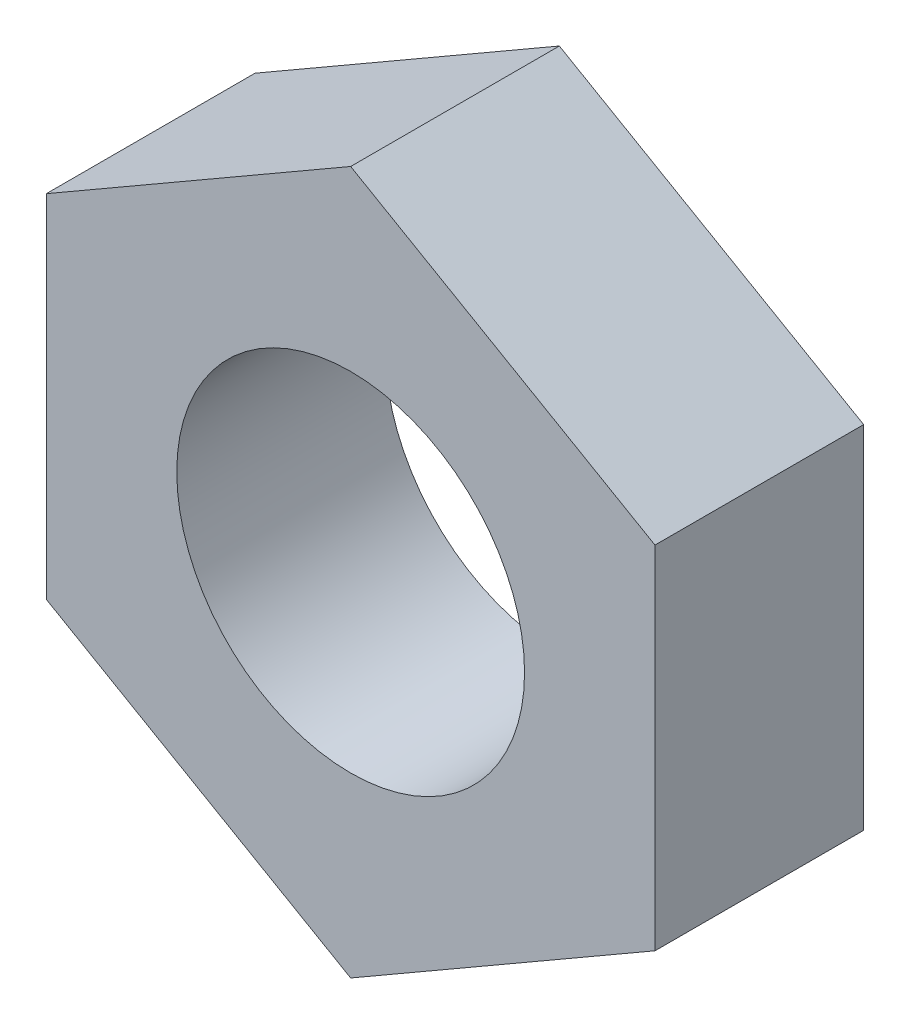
ISO-10303-21;
HEADER;
FILE_DESCRIPTION(('STEP AP214'),'2;1');
FILE_NAME('part.step','',(''),(''),'','','');
FILE_SCHEMA(('AUTOMOTIVE_DESIGN { 1 0 10303 214 1 1 1 1 }'));
ENDSEC;
DATA;
#1=APPLICATION_CONTEXT('core data for automotive mechanical design processes');
#2=APPLICATION_PROTOCOL_DEFINITION('international standard','automotive_design',2000,#1);
#3=PRODUCT_CONTEXT('',#1,'mechanical');
#4=PRODUCT('Part','Part','',(#3));
#5=PRODUCT_RELATED_PRODUCT_CATEGORY('part','',(#4));
#6=PRODUCT_DEFINITION_FORMATION('','',#4);
#7=PRODUCT_DEFINITION_CONTEXT('part definition',#1,'design');
#8=PRODUCT_DEFINITION('design','',#6,#7);
#9=PRODUCT_DEFINITION_SHAPE('','',#8);
#10=(LENGTH_UNIT() NAMED_UNIT(*) SI_UNIT(.MILLI.,.METRE.));
#11=(NAMED_UNIT(*) PLANE_ANGLE_UNIT() SI_UNIT($,.RADIAN.));
#12=(NAMED_UNIT(*) SI_UNIT($,.STERADIAN.) SOLID_ANGLE_UNIT());
#13=UNCERTAINTY_MEASURE_WITH_UNIT(LENGTH_MEASURE(1.E-05),#10,'distance_accuracy_value','');
#14=(GEOMETRIC_REPRESENTATION_CONTEXT(3) GLOBAL_UNCERTAINTY_ASSIGNED_CONTEXT((#13)) GLOBAL_UNIT_ASSIGNED_CONTEXT((#10,
#11,#12)) REPRESENTATION_CONTEXT('',''));
#15=CARTESIAN_POINT('',(0.,0.,0.));
#16=DIRECTION('',(0.,0.,1.));
#17=DIRECTION('',(1.,0.,0.));
#18=AXIS2_PLACEMENT_3D('',#15,#16,#17);
#19=CARTESIAN_POINT('',(3.5,2.02072594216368,2.4));
#20=DIRECTION('',(-0.5,-0.866025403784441,0.));
#21=DIRECTION('',(0.86602540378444,-0.5,0.));
#22=AXIS2_PLACEMENT_3D('',#19,#20,#21);
#23=PLANE('',#22);
#24=DIRECTION('',(-0.86602540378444,0.5,0.));
#25=VECTOR('',#24,1.);
#26=CARTESIAN_POINT('',(3.5,2.02072594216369,0.));
#27=LINE('',#26,#25);
#28=CARTESIAN_POINT('',(3.5,2.02072594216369,0.));
#29=VERTEX_POINT('',#28);
#30=CARTESIAN_POINT('',(0.,4.04145188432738,0.));
#31=VERTEX_POINT('',#30);
#32=EDGE_CURVE('E70',#29,#31,#27,.T.);
#33=ORIENTED_EDGE('',*,*,#32,.T.);
#34=DIRECTION('',(0.,0.,-1.));
#35=VECTOR('',#34,1.);
#36=CARTESIAN_POINT('',(0.,4.04145188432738,2.4));
#37=LINE('',#36,#35);
#38=CARTESIAN_POINT('',(0.,4.04145188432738,2.4));
#39=VERTEX_POINT('',#38);
#40=EDGE_CURVE('E9',#39,#31,#37,.T.);
#41=ORIENTED_EDGE('',*,*,#40,.F.);
#42=DIRECTION('',(-0.86602540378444,0.5,0.));
#43=VECTOR('',#42,1.);
#44=CARTESIAN_POINT('',(3.5,2.02072594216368,2.4));
#45=LINE('',#44,#43);
#46=CARTESIAN_POINT('',(3.5,2.02072594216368,2.4));
#47=VERTEX_POINT('',#46);
#48=EDGE_CURVE('E98',#47,#39,#45,.T.);
#49=ORIENTED_EDGE('',*,*,#48,.F.);
#50=DIRECTION('',(0.,0.,-1.));
#51=VECTOR('',#50,1.);
#52=CARTESIAN_POINT('',(3.5,2.02072594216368,2.4));
#53=LINE('',#52,#51);
#54=EDGE_CURVE('E83',#47,#29,#53,.T.);
#55=ORIENTED_EDGE('',*,*,#54,.T.);
#56=EDGE_LOOP('',(#33,#41,#49,#55));
#57=FACE_BOUND('',#56,.T.);
#58=ADVANCED_FACE('F14',(#57),#23,.F.);
#59=CARTESIAN_POINT('',(0.,4.04145188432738,2.4));
#60=DIRECTION('',(0.5,-0.866025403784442,0.));
#61=DIRECTION('',(0.866025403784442,0.5,0.));
#62=AXIS2_PLACEMENT_3D('',#59,#60,#61);
#63=PLANE('',#62);
#64=DIRECTION('',(-0.866025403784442,-0.5,0.));
#65=VECTOR('',#64,1.);
#66=CARTESIAN_POINT('',(0.,4.04145188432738,0.));
#67=LINE('',#66,#65);
#68=CARTESIAN_POINT('',(-3.5,2.0207259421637,0.));
#69=VERTEX_POINT('',#68);
#70=EDGE_CURVE('E66',#31,#69,#67,.T.);
#71=ORIENTED_EDGE('',*,*,#70,.T.);
#72=DIRECTION('',(0.,0.,-1.));
#73=VECTOR('',#72,1.);
#74=CARTESIAN_POINT('',(-3.5,2.02072594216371,2.39999999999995));
#75=LINE('',#74,#73);
#76=CARTESIAN_POINT('',(-3.5,2.02072594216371,2.39999999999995));
#77=VERTEX_POINT('',#76);
#78=EDGE_CURVE('E21',#77,#69,#75,.T.);
#79=ORIENTED_EDGE('',*,*,#78,.F.);
#80=DIRECTION('',(-0.866025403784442,-0.5,0.));
#81=VECTOR('',#80,1.);
#82=CARTESIAN_POINT('',(0.,4.04145188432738,2.4));
#83=LINE('',#82,#81);
#84=EDGE_CURVE('E79',#39,#77,#83,.T.);
#85=ORIENTED_EDGE('',*,*,#84,.F.);
#86=ORIENTED_EDGE('',*,*,#40,.T.);
#87=EDGE_LOOP('',(#71,#79,#85,#86));
#88=FACE_BOUND('',#87,.T.);
#89=ADVANCED_FACE('F78',(#88),#63,.F.);
#90=CARTESIAN_POINT('',(-3.5,2.02072594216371,2.39999999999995));
#91=DIRECTION('',(1.,0.,0.));
#92=DIRECTION('',(0.,1.,0.));
#93=AXIS2_PLACEMENT_3D('',#90,#91,#92);
#94=PLANE('',#93);
#95=DIRECTION('',(0.,-1.,0.));
#96=VECTOR('',#95,1.);
#97=CARTESIAN_POINT('',(-3.5,2.0207259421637,0.));
#98=LINE('',#97,#96);
#99=CARTESIAN_POINT('',(-3.5,-2.02072594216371,0.));
#100=VERTEX_POINT('',#99);
#101=EDGE_CURVE('E72',#69,#100,#98,.T.);
#102=ORIENTED_EDGE('',*,*,#101,.T.);
#103=DIRECTION('',(0.,0.,-1.));
#104=VECTOR('',#103,1.);
#105=CARTESIAN_POINT('',(-3.5,-2.0207259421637,2.39999999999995));
#106=LINE('',#105,#104);
#107=CARTESIAN_POINT('',(-3.5,-2.0207259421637,2.39999999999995));
#108=VERTEX_POINT('',#107);
#109=EDGE_CURVE('E114',#108,#100,#106,.T.);
#110=ORIENTED_EDGE('',*,*,#109,.F.);
#111=DIRECTION('',(0.,-1.,0.));
#112=VECTOR('',#111,1.);
#113=CARTESIAN_POINT('',(-3.5,2.02072594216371,2.39999999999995));
#114=LINE('',#113,#112);
#115=EDGE_CURVE('E101',#77,#108,#114,.T.);
#116=ORIENTED_EDGE('',*,*,#115,.F.);
#117=ORIENTED_EDGE('',*,*,#78,.T.);
#118=EDGE_LOOP('',(#102,#110,#116,#117));
#119=FACE_BOUND('',#118,.T.);
#120=ADVANCED_FACE('F118',(#119),#94,.F.);
#121=CARTESIAN_POINT('',(-3.5,-2.0207259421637,2.39999999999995));
#122=DIRECTION('',(0.5,0.866025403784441,0.));
#123=DIRECTION('',(-0.86602540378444,0.5,0.));
#124=AXIS2_PLACEMENT_3D('',#121,#122,#123);
#125=PLANE('',#124);
#126=DIRECTION('',(0.86602540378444,-0.5,0.));
#127=VECTOR('',#126,1.);
#128=CARTESIAN_POINT('',(-3.5,-2.02072594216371,0.));
#129=LINE('',#128,#127);
#130=CARTESIAN_POINT('',(0.,-4.0414518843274,0.));
#131=VERTEX_POINT('',#130);
#132=EDGE_CURVE('E92',#100,#131,#129,.T.);
#133=ORIENTED_EDGE('',*,*,#132,.T.);
#134=DIRECTION('',(0.,0.,-1.));
#135=VECTOR('',#134,1.);
#136=CARTESIAN_POINT('',(0.,-4.0414518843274,2.4));
#137=LINE('',#136,#135);
#138=CARTESIAN_POINT('',(0.,-4.0414518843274,2.4));
#139=VERTEX_POINT('',#138);
#140=EDGE_CURVE('E111',#139,#131,#137,.T.);
#141=ORIENTED_EDGE('',*,*,#140,.F.);
#142=DIRECTION('',(0.86602540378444,-0.5,0.));
#143=VECTOR('',#142,1.);
#144=CARTESIAN_POINT('',(-3.5,-2.0207259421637,2.39999999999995));
#145=LINE('',#144,#143);
#146=EDGE_CURVE('E103',#108,#139,#145,.T.);
#147=ORIENTED_EDGE('',*,*,#146,.F.);
#148=ORIENTED_EDGE('',*,*,#109,.T.);
#149=EDGE_LOOP('',(#133,#141,#147,#148));
#150=FACE_BOUND('',#149,.T.);
#151=ADVANCED_FACE('F124',(#150),#125,.F.);
#152=CARTESIAN_POINT('',(0.,-4.0414518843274,2.4));
#153=DIRECTION('',(-0.5,0.866025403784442,0.));
#154=DIRECTION('',(-0.866025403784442,-0.5,0.));
#155=AXIS2_PLACEMENT_3D('',#152,#153,#154);
#156=PLANE('',#155);
#157=DIRECTION('',(0.866025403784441,0.5,0.));
#158=VECTOR('',#157,1.);
#159=CARTESIAN_POINT('',(0.,-4.0414518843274,0.));
#160=LINE('',#159,#158);
#161=CARTESIAN_POINT('',(3.50000000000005,-2.02072594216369,0.));
#162=VERTEX_POINT('',#161);
#163=EDGE_CURVE('E94',#131,#162,#160,.T.);
#164=ORIENTED_EDGE('',*,*,#163,.T.);
#165=DIRECTION('',(0.,0.,-1.));
#166=VECTOR('',#165,1.);
#167=CARTESIAN_POINT('',(3.5,-2.02072594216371,2.4));
#168=LINE('',#167,#166);
#169=CARTESIAN_POINT('',(3.5,-2.02072594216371,2.4));
#170=VERTEX_POINT('',#169);
#171=EDGE_CURVE('E108',#170,#162,#168,.T.);
#172=ORIENTED_EDGE('',*,*,#171,.F.);
#173=DIRECTION('',(0.866025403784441,0.5,0.));
#174=VECTOR('',#173,1.);
#175=CARTESIAN_POINT('',(0.,-4.0414518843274,2.4));
#176=LINE('',#175,#174);
#177=EDGE_CURVE('E33',#139,#170,#176,.T.);
#178=ORIENTED_EDGE('',*,*,#177,.F.);
#179=ORIENTED_EDGE('',*,*,#140,.T.);
#180=EDGE_LOOP('',(#164,#172,#178,#179));
#181=FACE_BOUND('',#180,.T.);
#182=ADVANCED_FACE('F127',(#181),#156,.F.);
#183=CARTESIAN_POINT('',(3.5,-2.02072594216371,2.4));
#184=DIRECTION('',(-1.,0.,0.));
#185=DIRECTION('',(0.,-1.,0.));
#186=AXIS2_PLACEMENT_3D('',#183,#184,#185);
#187=PLANE('',#186);
#188=DIRECTION('',(0.,1.,0.));
#189=VECTOR('',#188,1.);
#190=CARTESIAN_POINT('',(3.50000000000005,-2.02072594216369,0.));
#191=LINE('',#190,#189);
#192=EDGE_CURVE('E96',#162,#29,#191,.T.);
#193=ORIENTED_EDGE('',*,*,#192,.T.);
#194=ORIENTED_EDGE('',*,*,#54,.F.);
#195=DIRECTION('',(0.,1.,0.));
#196=VECTOR('',#195,1.);
#197=CARTESIAN_POINT('',(3.5,-2.02072594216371,2.4));
#198=LINE('',#197,#196);
#199=EDGE_CURVE('E28',#170,#47,#198,.T.);
#200=ORIENTED_EDGE('',*,*,#199,.F.);
#201=ORIENTED_EDGE('',*,*,#171,.T.);
#202=EDGE_LOOP('',(#193,#194,#200,#201));
#203=FACE_BOUND('',#202,.T.);
#204=ADVANCED_FACE('F129',(#203),#187,.F.);
#205=CARTESIAN_POINT('',(-3.5,6.06217782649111,2.39999999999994));
#206=DIRECTION('',(0.,0.,1.));
#207=DIRECTION('',(0.,-1.,0.));
#208=AXIS2_PLACEMENT_3D('',#205,#206,#207);
#209=PLANE('',#208);
#210=CARTESIAN_POINT('',(0.,0.,2.39999999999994));
#211=DIRECTION('',(0.,0.,1.));
#212=DIRECTION('',(0.,-1.,0.));
#213=AXIS2_PLACEMENT_3D('',#210,#211,#212);
#214=CIRCLE('',#213,2.);
#215=CARTESIAN_POINT('',(0.,-2.,2.39999999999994));
#216=VERTEX_POINT('',#215);
#217=EDGE_CURVE('E87',#216,#216,#214,.T.);
#218=ORIENTED_EDGE('',*,*,#217,.F.);
#219=EDGE_LOOP('',(#218));
#220=FACE_BOUND('',#219,.T.);
#221=ORIENTED_EDGE('',*,*,#48,.T.);
#222=ORIENTED_EDGE('',*,*,#84,.T.);
#223=ORIENTED_EDGE('',*,*,#115,.T.);
#224=ORIENTED_EDGE('',*,*,#146,.T.);
#225=ORIENTED_EDGE('',*,*,#177,.T.);
#226=ORIENTED_EDGE('',*,*,#199,.T.);
#227=EDGE_LOOP('',(#221,#222,#223,#224,#225,#226));
#228=FACE_BOUND('',#227,.T.);
#229=ADVANCED_FACE('F121',(#220,#228),#209,.T.);
#230=CARTESIAN_POINT('',(-3.5,6.06217782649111,0.));
#231=DIRECTION('',(0.,0.,1.));
#232=DIRECTION('',(0.,-1.,0.));
#233=AXIS2_PLACEMENT_3D('',#230,#231,#232);
#234=PLANE('',#233);
#235=CARTESIAN_POINT('',(0.,0.,0.));
#236=DIRECTION('',(0.,0.,1.));
#237=DIRECTION('',(0.,-1.,0.));
#238=AXIS2_PLACEMENT_3D('',#235,#236,#237);
#239=CIRCLE('',#238,2.);
#240=CARTESIAN_POINT('',(0.,-2.,0.));
#241=VERTEX_POINT('',#240);
#242=EDGE_CURVE('E84',#241,#241,#239,.T.);
#243=ORIENTED_EDGE('',*,*,#242,.T.);
#244=EDGE_LOOP('',(#243));
#245=FACE_BOUND('',#244,.T.);
#246=ORIENTED_EDGE('',*,*,#32,.F.);
#247=ORIENTED_EDGE('',*,*,#192,.F.);
#248=ORIENTED_EDGE('',*,*,#163,.F.);
#249=ORIENTED_EDGE('',*,*,#132,.F.);
#250=ORIENTED_EDGE('',*,*,#101,.F.);
#251=ORIENTED_EDGE('',*,*,#70,.F.);
#252=EDGE_LOOP('',(#246,#247,#248,#249,#250,#251));
#253=FACE_BOUND('',#252,.T.);
#254=ADVANCED_FACE('F67',(#245,#253),#234,.F.);
#255=CARTESIAN_POINT('',(0.,0.,0.));
#256=DIRECTION('',(0.,0.,1.));
#257=DIRECTION('',(0.,-1.,0.));
#258=AXIS2_PLACEMENT_3D('',#255,#256,#257);
#259=CYLINDRICAL_SURFACE('',#258,2.);
#260=ORIENTED_EDGE('',*,*,#242,.F.);
#261=EDGE_LOOP('',(#260));
#262=FACE_BOUND('',#261,.T.);
#263=ORIENTED_EDGE('',*,*,#217,.T.);
#264=EDGE_LOOP('',(#263));
#265=FACE_BOUND('',#264,.T.);
#266=ADVANCED_FACE('F199',(#262,#265),#259,.F.);
#267=CLOSED_SHELL('',(#58,#89,#120,#151,#182,#204,#229,#254,#266));
#268=MANIFOLD_SOLID_BREP('B1',#267);
#269=ADVANCED_BREP_SHAPE_REPRESENTATION('',(#18,#268),#14);
#270=SHAPE_DEFINITION_REPRESENTATION(#9,#269);
ENDSEC;
END-ISO-10303-21;
